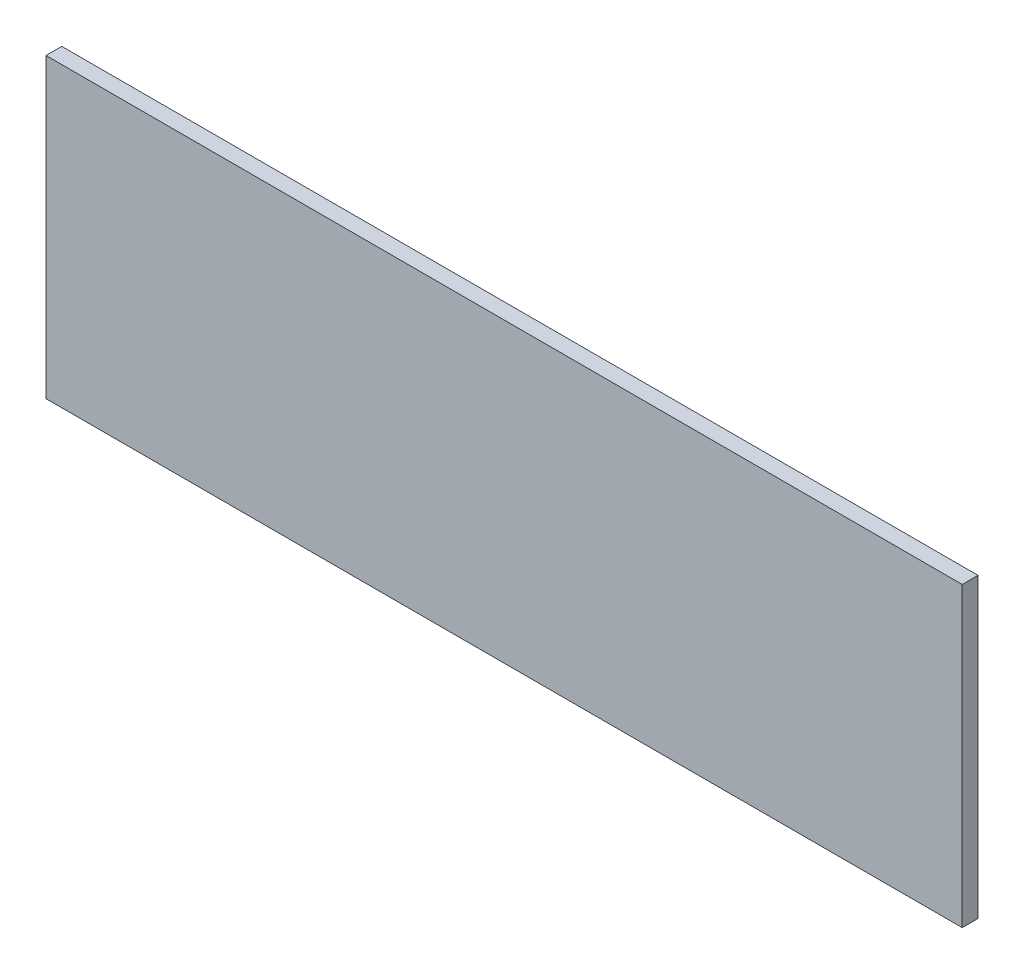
from build123d import *

# Parameters (mm, degrees)
BOSS_EXTRU_1_DEPTH = 10


with BuildPart() as part:
    # Esquisse1 → Boss.-Extru.1 (new body)
    with BuildSketch(Plane.XY):
        Polygon((-105.86311886, -249.252832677), (-105.86311886, -259.252832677), (-105.86311886, -427.402832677), (-105.86311886, -437.402832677), (474.13688114, -437.402832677), (474.13688114, -427.402832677), (474.13688114, -249.252832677), align=None)
    extrude(amount=BOSS_EXTRU_1_DEPTH)


solid = part.part
